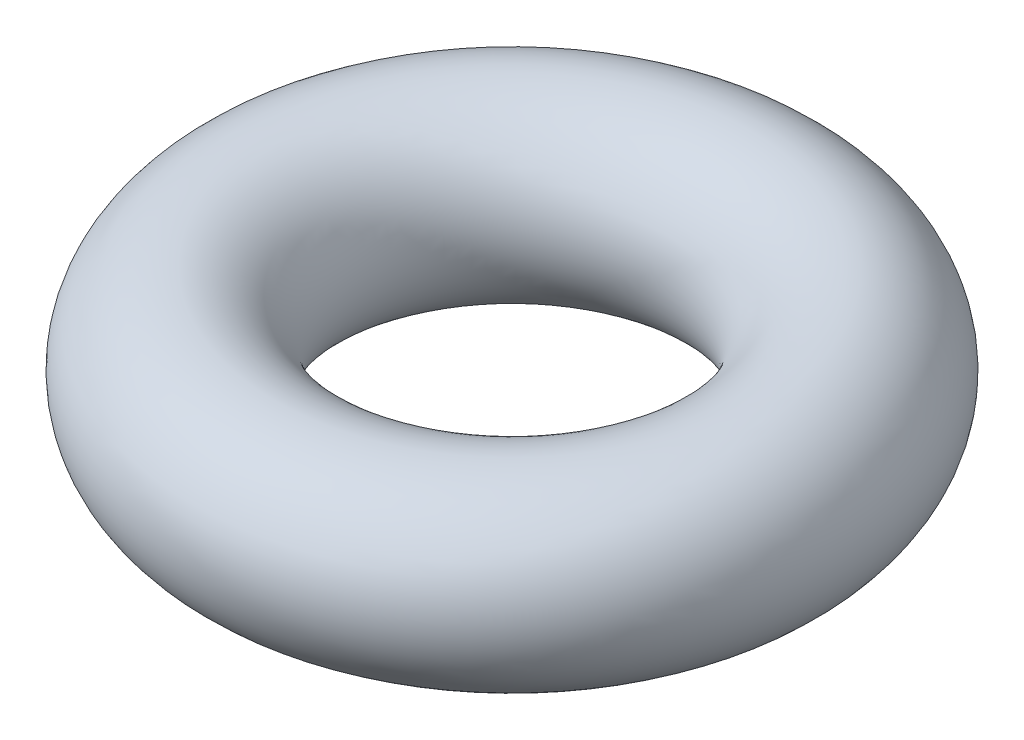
from build123d import *

# Parameters (mm, degrees)
SKETCH1_R = 0.889


with BuildPart() as part:
    # Sketch1 → Revolve1 (revolve)
    with BuildSketch(Plane.XY, mode=Mode.PRIVATE) as revolve1_sk:
        with Locations((-2.3368, 0)):
            Circle(SKETCH1_R)
    revolve(revolve1_sk.sketch.rotate(Axis((0, 0, 0), (0, 1, 0)), 270), axis=Axis((0, 0, 0), (0, 1, 0)))


solid = part.part
